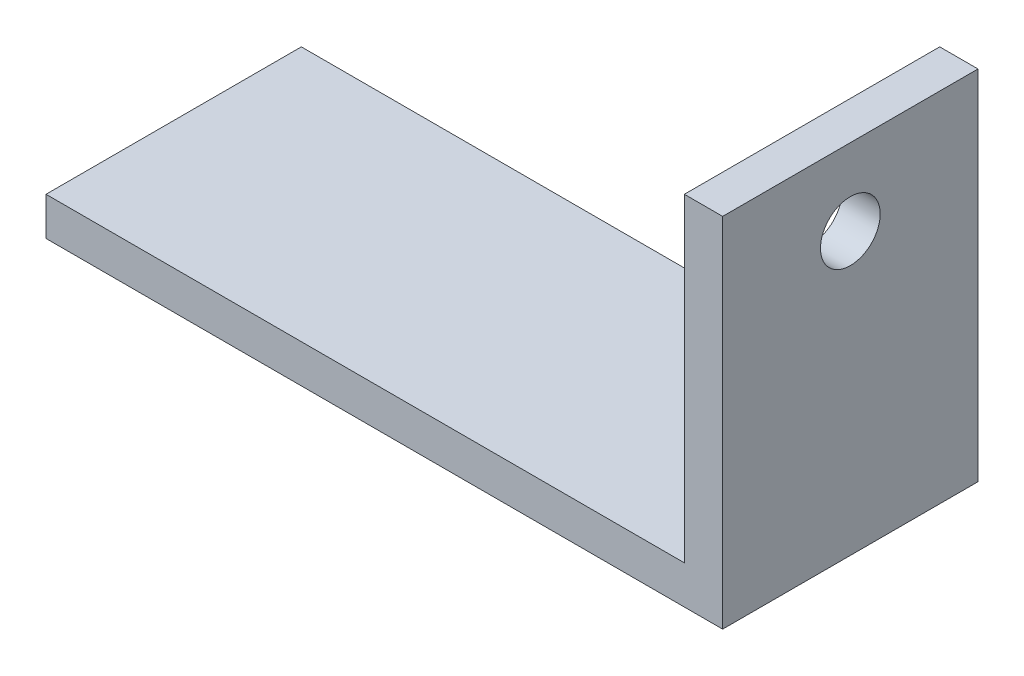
from build123d import *

# Parameters (mm, degrees)
BOSS_EXTRUDE1_DEPTH = 20
SKETCH2_R           = 2.34
CUT_EXTRUDE1_DEPTH  = 20


with BuildPart() as part:
    # Sketch1 → Boss-Extrude1 (new body)
    with BuildSketch(Plane.XY):
        Polygon((0, 0), (0, -25), (-50, -25), (-50, -28), (3, -28), (3, 0), align=None)
    extrude(amount=BOSS_EXTRUDE1_DEPTH)

    # Sketch2 → Cut-Extrude1 (cut)
    with BuildSketch(Plane(origin=(3, 0, 0), x_dir=(0, 0, -1), z_dir=(1, 0, 0))):
        with Locations((-10, -6)):
            Circle(SKETCH2_R)
    extrude(amount=-CUT_EXTRUDE1_DEPTH, mode=Mode.SUBTRACT)


solid = part.part
